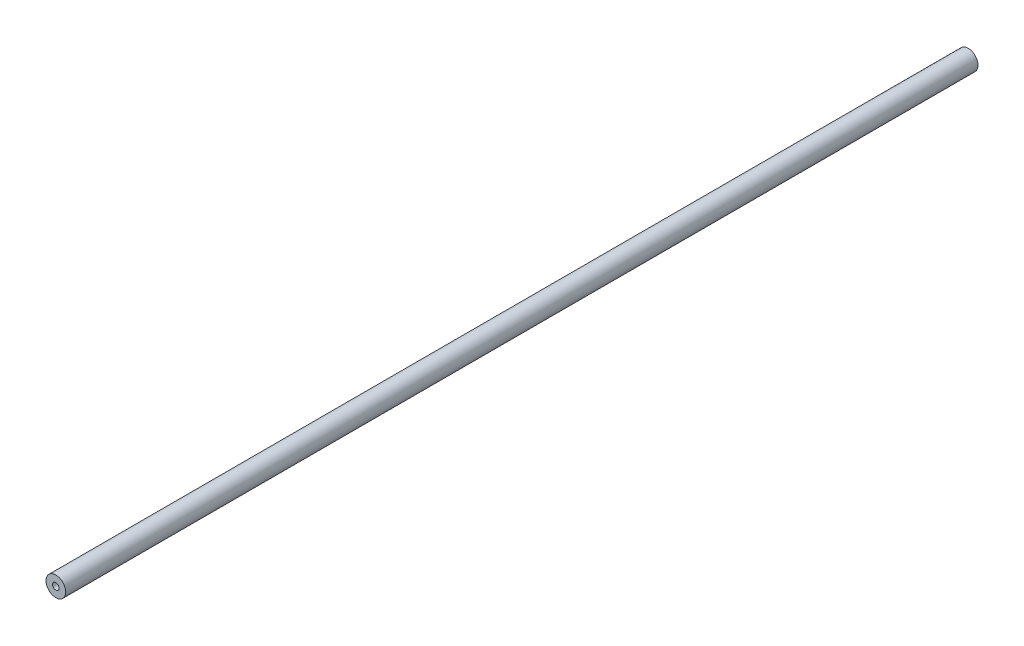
from build123d import *

# Parameters (mm, degrees)
ESQUISSE1_R               = 7.5
EXTRUSION1_DEPTH          = 347.5
TROU_TARAUD_M6X1_01_D     = 5
TROU_TARAUD_M6X1_01_DEPTH = 20
TROU_TARAUD_M6X1_01_TIP   = 1.502151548
TROU_TARAUD_M6X1_02_D     = 5
TROU_TARAUD_M6X1_02_DEPTH = 20
TROU_TARAUD_M6X1_02_TIP   = 1.502151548


with BuildPart() as part:
    # Esquisse1 → Extrusion1 (new, symmetric)
    with BuildSketch(Plane.XY):
        Circle(ESQUISSE1_R)
    extrude(amount=EXTRUSION1_DEPTH, both=True)

    # Trou taraud_ M6x1.01
    with Locations(Plane.XY.offset(347.5)):
        with Locations((0, 0)):
            Hole(TROU_TARAUD_M6X1_01_D / 2, depth=TROU_TARAUD_M6X1_01_DEPTH)
            with Locations((0, 0, -(TROU_TARAUD_M6X1_01_DEPTH + TROU_TARAUD_M6X1_01_TIP / 2))):  # 118° drill point
                Cone(0, TROU_TARAUD_M6X1_01_D / 2, TROU_TARAUD_M6X1_01_TIP, mode=Mode.SUBTRACT)

    # Trou taraud_ M6x1.02
    with Locations(Plane(origin=(0, 0, -347.5), x_dir=(-1, 0, 0), z_dir=(0, 0, -1))):
        with Locations((0, 0)):
            Hole(TROU_TARAUD_M6X1_02_D / 2, depth=TROU_TARAUD_M6X1_02_DEPTH)
            with Locations((0, 0, -(TROU_TARAUD_M6X1_02_DEPTH + TROU_TARAUD_M6X1_02_TIP / 2))):  # 118° drill point
                Cone(0, TROU_TARAUD_M6X1_02_D / 2, TROU_TARAUD_M6X1_02_TIP, mode=Mode.SUBTRACT)


solid = part.part
